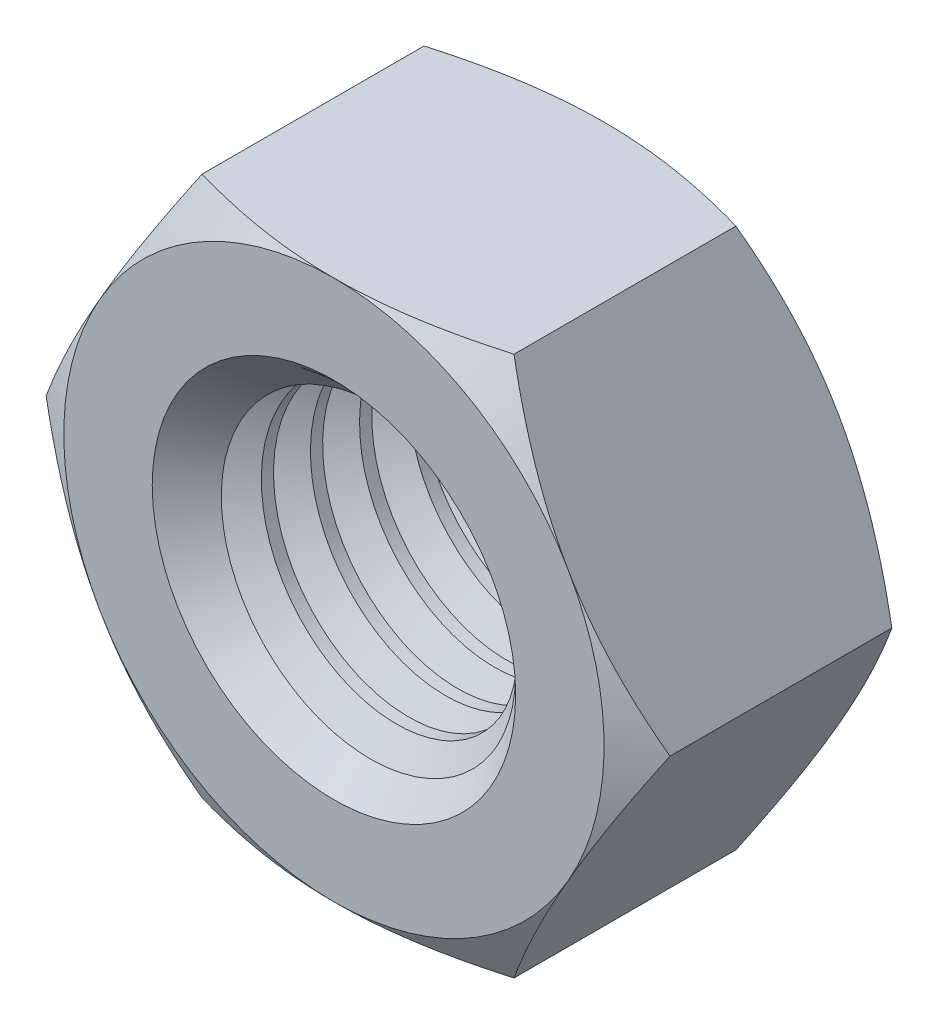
from build123d import *

# Parameters (mm, degrees)
Y_KSEKLIK_EKSTR_ZYON1_DEPTH = 5.5
IZIM2_OUTSIDE_W             = 37.29
IZIM2_OUTSIDE_H             = 35.588
IZIM2_OUTSIDE_R             = 5.5
KES_EKSTR_ZYON1_DEPTH       = 5.5
KES_EKSTR_ZYON1_DRAFT       = -60
IZIM3_OUTSIDE_W             = 37.29
IZIM3_OUTSIDE_H             = 35.588
IZIM3_OUTSIDE_R             = 5.5
KES_EKSTR_ZYON2_DEPTH       = 5.5
KES_EKSTR_ZYON2_DRAFT       = -60
IZIM4_R                     = 2.85
KES_EKSTR_ZYON3_DEPTH       = 5.5
PAH1_SIZE                   = 0.85
KES_S_P_R1_PITCH            = 1
KES_S_P_R1_HEIGHT           = 7
KES_S_P_R1_RADIUS           = 2.85


with BuildPart() as part:
    # izim1 → Y_kseklik-Ekstr_zyon1 (new body)
    with BuildSketch(Plane.XY):
        Polygon((6.350852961, 0), (3.175426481, 5.5), (-3.175426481, 5.5), (-6.350852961, 0), (-3.175426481, -5.5), (3.175426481, -5.5), align=None)
    extrude(amount=Y_KSEKLIK_EKSTR_ZYON1_DEPTH)


with BuildPart() as kes_ekstr_zyon1_tool:
    # izim2 outside → Kes-Ekstr_zyon1 (with draft: the straight prism first)
    with BuildSketch(Plane.XY.offset(5.5)):
        Rectangle(IZIM2_OUTSIDE_W, IZIM2_OUTSIDE_H)
        Circle(IZIM2_OUTSIDE_R, mode=Mode.SUBTRACT)
    extrude(amount=-KES_EKSTR_ZYON1_DEPTH)
    # Kes-Ekstr_zyon1: the draft: its side faces are tilted about the plane it starts from
    kes_ekstr_zyon1_sides = [kes_ekstr_zyon1_tool.faces().sort_by_distance(p)[0] for p in [
        (0, -17.794, 2.75),
        (18.645, 0, 2.75),
        (0, 17.794, 2.75),
        (-18.645, 0, 2.75),
        (-5.5, 0, 2.75),
    ]]
    draft(kes_ekstr_zyon1_sides, Plane.XY.offset(5.5), KES_EKSTR_ZYON1_DRAFT)


with BuildPart() as part_1:
    add(part.part)

    # Kes-Ekstr_zyon1: cut by kes_ekstr_zyon1_tool
    add(kes_ekstr_zyon1_tool.part, mode=Mode.SUBTRACT)


with BuildPart() as kes_ekstr_zyon2_tool:
    # izim3 outside → Kes-Ekstr_zyon2 (with draft: the straight prism first)
    with BuildSketch(Plane(origin=(0, 0, 0), x_dir=(-1, 0, 0), z_dir=(0, 0, -1))):
        Rectangle(IZIM3_OUTSIDE_W, IZIM3_OUTSIDE_H)
        Circle(IZIM3_OUTSIDE_R, mode=Mode.SUBTRACT)
    extrude(amount=-KES_EKSTR_ZYON2_DEPTH)
    # Kes-Ekstr_zyon2: the draft: its side faces are tilted about the plane it starts from
    kes_ekstr_zyon2_sides = [kes_ekstr_zyon2_tool.faces().sort_by_distance(p)[0] for p in [
        (0, -17.794, 2.75),
        (-18.645, 0, 2.75),
        (0, 17.794, 2.75),
        (18.645, 0, 2.75),
        (5.5, 0, 2.75),
    ]]
    draft(kes_ekstr_zyon2_sides, Plane(origin=(0, 0, 0), x_dir=(-1, 0, 0), z_dir=(0, 0, -1)), KES_EKSTR_ZYON2_DRAFT)


with BuildPart() as part_2:
    add(part_1.part)

    # Kes-Ekstr_zyon2: cut by kes_ekstr_zyon2_tool
    add(kes_ekstr_zyon2_tool.part, mode=Mode.SUBTRACT)

    # izim4 → Kes-Ekstr_zyon3 (cut)
    with BuildSketch(Plane(origin=(0, 0, 0), x_dir=(-1, 0, 0), z_dir=(0, 0, -1))):
        Circle(IZIM4_R)
    extrude(amount=-KES_EKSTR_ZYON3_DEPTH, mode=Mode.SUBTRACT)

    # Pah1
    pah1_edges = [part_2.edges().sort_by_distance(p)[0] for p in [
        (2.85, 0, 5.5),
        (2.85, 0, 0),
    ]]
    chamfer(pah1_edges, length=PAH1_SIZE)

    # Kes-S_p_r1: sweep along a helix
    with BuildLine() as kes_s_p_r1_path:
        Helix(KES_S_P_R1_PITCH, KES_S_P_R1_HEIGHT, KES_S_P_R1_RADIUS, center=(0, 0, 0), direction=(0, 0, 1))
    # izim6 → Kes-S_p_r1 (sweep, cut)
    with BuildSketch(Plane(origin=(2.85, 0, 7), x_dir=(1, 0, 0), z_dir=(-9.111516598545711e-14, 0.9984443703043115, 0.05575696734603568))):
        Polygon((0.65, 0), (-0.189797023, 0.484857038), (-0.189797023, -0.484857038), align=None)
    sweep(path=kes_s_p_r1_path.line, is_frenet=True, mode=Mode.SUBTRACT)


solid = part_2.part
